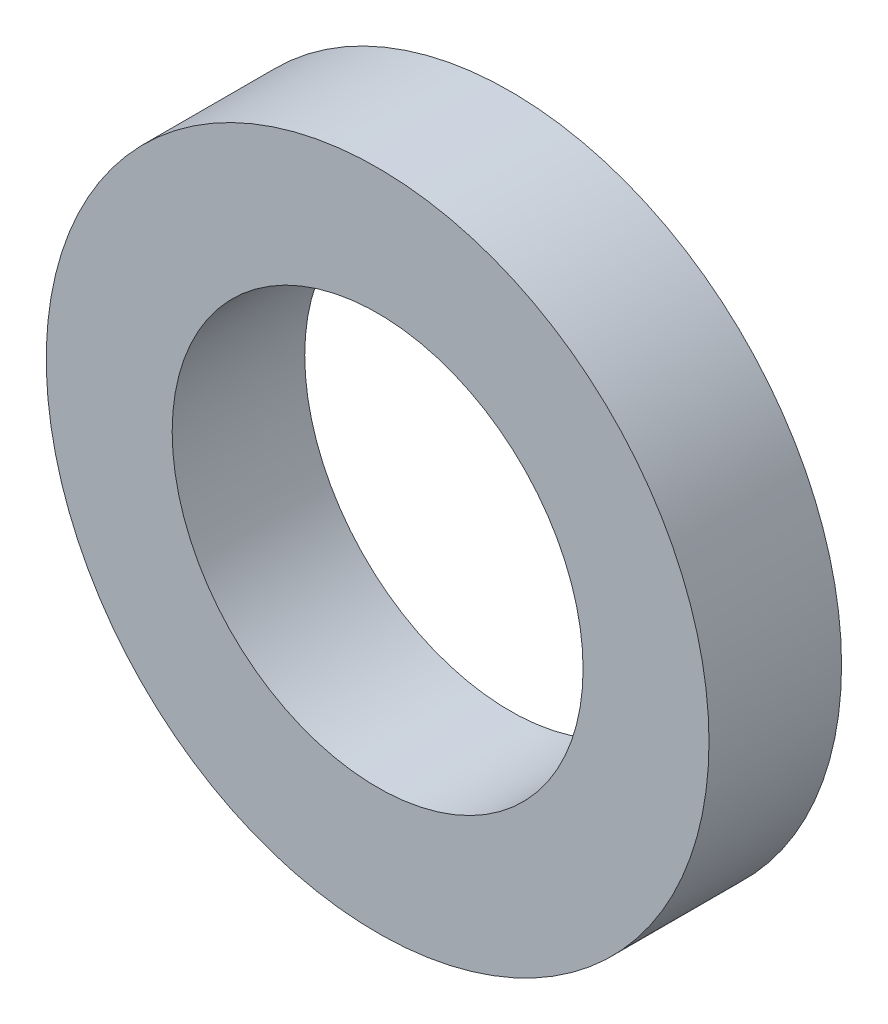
ISO-10303-21;
HEADER;
FILE_DESCRIPTION(('STEP AP214'),'2;1');
FILE_NAME('part.step','',(''),(''),'','','');
FILE_SCHEMA(('AUTOMOTIVE_DESIGN { 1 0 10303 214 1 1 1 1 }'));
ENDSEC;
DATA;
#1=APPLICATION_CONTEXT('core data for automotive mechanical design processes');
#2=APPLICATION_PROTOCOL_DEFINITION('international standard','automotive_design',2000,#1);
#3=PRODUCT_CONTEXT('',#1,'mechanical');
#4=PRODUCT('Part','Part','',(#3));
#5=PRODUCT_RELATED_PRODUCT_CATEGORY('part','',(#4));
#6=PRODUCT_DEFINITION_FORMATION('','',#4);
#7=PRODUCT_DEFINITION_CONTEXT('part definition',#1,'design');
#8=PRODUCT_DEFINITION('design','',#6,#7);
#9=PRODUCT_DEFINITION_SHAPE('','',#8);
#10=(LENGTH_UNIT() NAMED_UNIT(*) SI_UNIT(.MILLI.,.METRE.));
#11=(NAMED_UNIT(*) PLANE_ANGLE_UNIT() SI_UNIT($,.RADIAN.));
#12=(NAMED_UNIT(*) SI_UNIT($,.STERADIAN.) SOLID_ANGLE_UNIT());
#13=UNCERTAINTY_MEASURE_WITH_UNIT(LENGTH_MEASURE(1.E-05),#10,'distance_accuracy_value','');
#14=(GEOMETRIC_REPRESENTATION_CONTEXT(3) GLOBAL_UNCERTAINTY_ASSIGNED_CONTEXT((#13)) GLOBAL_UNIT_ASSIGNED_CONTEXT((#10,
#11,#12)) REPRESENTATION_CONTEXT('',''));
#15=CARTESIAN_POINT('',(0.,0.,0.));
#16=DIRECTION('',(0.,0.,1.));
#17=DIRECTION('',(1.,0.,0.));
#18=AXIS2_PLACEMENT_3D('',#15,#16,#17);
#19=CARTESIAN_POINT('',(0.,0.,5.));
#20=DIRECTION('',(0.,0.,1.));
#21=DIRECTION('',(1.,0.,0.));
#22=AXIS2_PLACEMENT_3D('',#19,#20,#21);
#23=PLANE('',#22);
#24=CARTESIAN_POINT('',(0.,0.,5.));
#25=DIRECTION('',(0.,0.,1.));
#26=DIRECTION('',(1.,0.,0.));
#27=AXIS2_PLACEMENT_3D('',#24,#25,#26);
#28=CIRCLE('',#27,12.5);
#29=CARTESIAN_POINT('',(12.5,0.,5.));
#30=VERTEX_POINT('',#29);
#31=EDGE_CURVE('E10',#30,#30,#28,.T.);
#32=ORIENTED_EDGE('',*,*,#31,.T.);
#33=EDGE_LOOP('',(#32));
#34=FACE_BOUND('',#33,.T.);
#35=CARTESIAN_POINT('',(0.,0.,5.));
#36=DIRECTION('',(0.,0.,1.));
#37=DIRECTION('',(1.,0.,0.));
#38=AXIS2_PLACEMENT_3D('',#35,#36,#37);
#39=CIRCLE('',#38,7.75);
#40=CARTESIAN_POINT('',(7.75,0.,5.));
#41=VERTEX_POINT('',#40);
#42=EDGE_CURVE('E40',#41,#41,#39,.T.);
#43=ORIENTED_EDGE('',*,*,#42,.F.);
#44=EDGE_LOOP('',(#43));
#45=FACE_BOUND('',#44,.T.);
#46=ADVANCED_FACE('F29',(#34,#45),#23,.T.);
#47=CARTESIAN_POINT('',(0.,0.,0.));
#48=DIRECTION('',(0.,0.,1.));
#49=DIRECTION('',(1.,0.,0.));
#50=AXIS2_PLACEMENT_3D('',#47,#48,#49);
#51=PLANE('',#50);
#52=CARTESIAN_POINT('',(0.,0.,0.));
#53=DIRECTION('',(0.,0.,1.));
#54=DIRECTION('',(1.,0.,0.));
#55=AXIS2_PLACEMENT_3D('',#52,#53,#54);
#56=CIRCLE('',#55,12.5);
#57=CARTESIAN_POINT('',(12.5,0.,0.));
#58=VERTEX_POINT('',#57);
#59=EDGE_CURVE('E33',#58,#58,#56,.T.);
#60=ORIENTED_EDGE('',*,*,#59,.F.);
#61=EDGE_LOOP('',(#60));
#62=FACE_BOUND('',#61,.T.);
#63=CARTESIAN_POINT('',(0.,0.,0.));
#64=DIRECTION('',(0.,0.,1.));
#65=DIRECTION('',(1.,0.,0.));
#66=AXIS2_PLACEMENT_3D('',#63,#64,#65);
#67=CIRCLE('',#66,7.75);
#68=CARTESIAN_POINT('',(7.75,0.,0.));
#69=VERTEX_POINT('',#68);
#70=EDGE_CURVE('E42',#69,#69,#67,.T.);
#71=ORIENTED_EDGE('',*,*,#70,.T.);
#72=EDGE_LOOP('',(#71));
#73=FACE_BOUND('',#72,.T.);
#74=ADVANCED_FACE('F52',(#62,#73),#51,.F.);
#75=CARTESIAN_POINT('',(0.,0.,5.));
#76=DIRECTION('',(0.,0.,-1.));
#77=DIRECTION('',(-1.,0.,0.));
#78=AXIS2_PLACEMENT_3D('',#75,#76,#77);
#79=CYLINDRICAL_SURFACE('',#78,12.5);
#80=ORIENTED_EDGE('',*,*,#31,.F.);
#81=EDGE_LOOP('',(#80));
#82=FACE_BOUND('',#81,.T.);
#83=ORIENTED_EDGE('',*,*,#59,.T.);
#84=EDGE_LOOP('',(#83));
#85=FACE_BOUND('',#84,.T.);
#86=ADVANCED_FACE('F31',(#82,#85),#79,.T.);
#87=CARTESIAN_POINT('',(0.,0.,5.));
#88=DIRECTION('',(0.,0.,-1.));
#89=DIRECTION('',(-1.,0.,0.));
#90=AXIS2_PLACEMENT_3D('',#87,#88,#89);
#91=CYLINDRICAL_SURFACE('',#90,7.75);
#92=ORIENTED_EDGE('',*,*,#42,.T.);
#93=EDGE_LOOP('',(#92));
#94=FACE_BOUND('',#93,.T.);
#95=ORIENTED_EDGE('',*,*,#70,.F.);
#96=EDGE_LOOP('',(#95));
#97=FACE_BOUND('',#96,.T.);
#98=ADVANCED_FACE('F48',(#94,#97),#91,.F.);
#99=CLOSED_SHELL('',(#46,#74,#86,#98));
#100=MANIFOLD_SOLID_BREP('B2',#99);
#101=ADVANCED_BREP_SHAPE_REPRESENTATION('',(#18,#100),#14);
#102=SHAPE_DEFINITION_REPRESENTATION(#9,#101);
ENDSEC;
END-ISO-10303-21;
